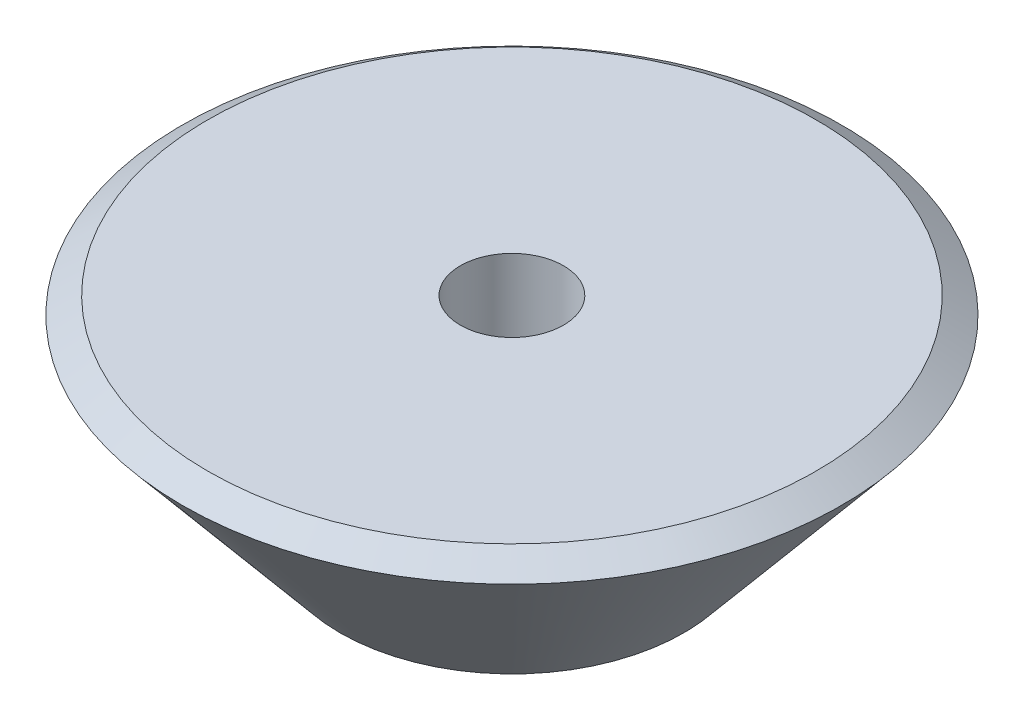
from build123d import *

# Parameters (mm, degrees)
ESQUISSE3_R             = 1
ENL_V_MAT_EXTRU_1_DEPTH = 10


with BuildPart() as part:
    # Esquisse2 → Base-R_volution (revolve)
    with BuildSketch(Plane.XY, mode=Mode.PRIVATE) as base_r_volution_sk:
        Polygon((0, 8), (0, 4), (-3.333333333, 4), (-6.390638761, 7.668766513), (-5.899922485, 8), align=None)
    revolve(base_r_volution_sk.sketch.rotate(Axis((0, 9.437478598, 0), (0, -1, 0)), 270), axis=Axis((0, 9.437478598, 0), (0, -1, 0)))

    # Esquisse3 → Enl_v. mat.-Extru.1 (cut)
    with BuildSketch(Plane(origin=(0, 8, 0), x_dir=(-1, 0, 0), z_dir=(0, 1, 0))):
        with Locations(Location((0, 0, 0), (0, 0, 90))):
            Circle(ESQUISSE3_R)
    extrude(amount=-ENL_V_MAT_EXTRU_1_DEPTH, mode=Mode.SUBTRACT)


solid = part.part
